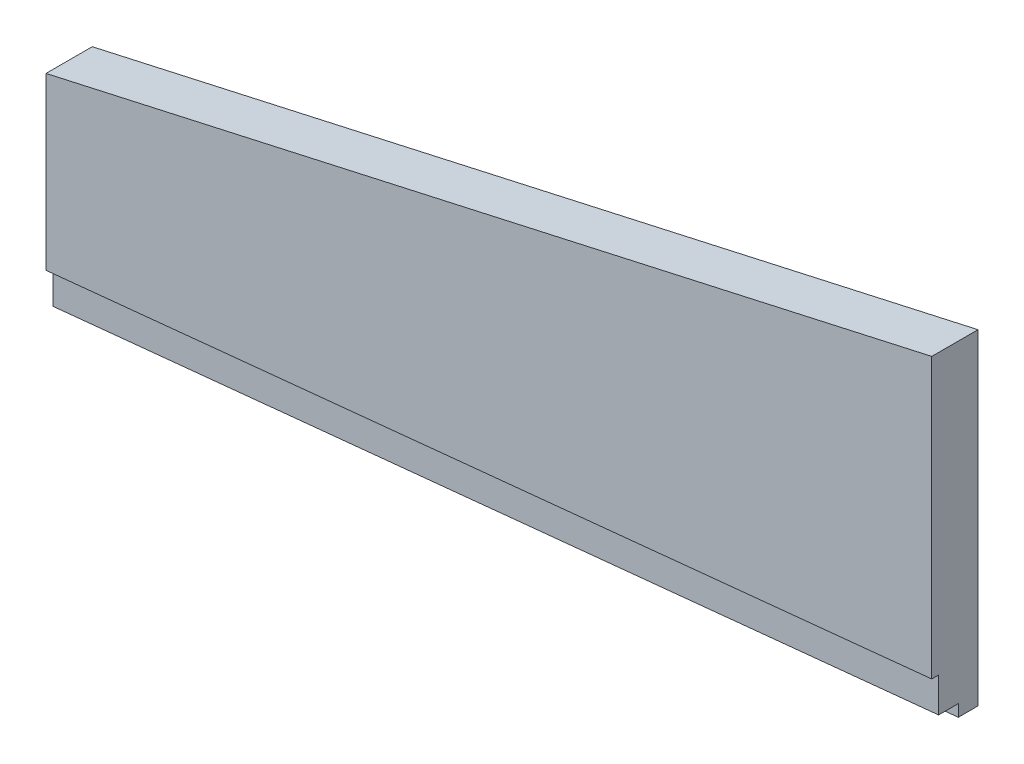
from build123d import *

# Parameters (mm, degrees)
EXTRUDE_1_DEPTH = 47
EXTRUDE_2_DEPTH = 40
EXTRUDE_3_DEPTH = 20


with BuildPart() as part:
    # Sketch 1 → Extrude 1 (new body)
    with BuildSketch(Plane.XY):
        Polygon((0, -1226.738436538), (0, -1510.603294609), (-900, -1601.000259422), (-900, -1427.719077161), align=None)
    extrude(amount=EXTRUDE_1_DEPTH)

    # Sketch 2 → Extrude 2 (add)
    with BuildSketch(Plane(origin=(0, 0, 0), x_dir=(-1, 0, 0), z_dir=(0, 0, -1))):
        Polygon((0, -1510.603294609), (0, -1545.779398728), (900, -1636.17636354), (900, -1601.000259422), align=None)
    extrude(amount=-EXTRUDE_2_DEPTH)

    # Sketch 3 → Extrude 3 (add)
    with BuildSketch(Plane(origin=(0, 0, 0), x_dir=(-1, 0, 0), z_dir=(0, 0, -1))):
        Polygon((0, -1545.779398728), (0, -1557.839777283), (900, -1648.236742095), (900, -1636.17636354), align=None)
    extrude(amount=-EXTRUDE_3_DEPTH)


solid = part.part
